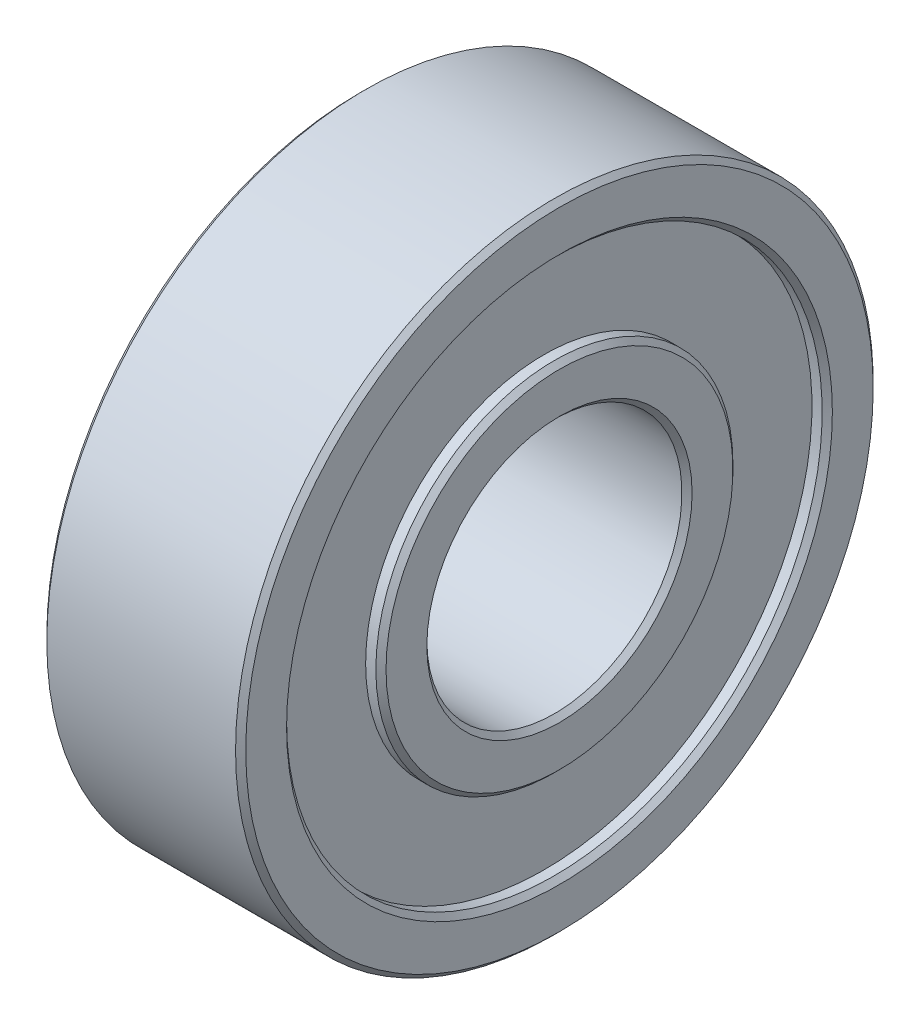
from build123d import *


with BuildPart() as part:
    # Sketch1 → Revolve1 (revolve)
    with BuildSketch(Plane(origin=(0, 0, 0), x_dir=(1, 0, 0), z_dir=(0, 1, 0)), mode=Mode.PRIVATE) as revolve1_sk:
        Polygon((0.127, 3.175), (4.826, 3.175), (4.953, 3.302), (4.953, 4.318), (4.826, 4.445), (4.572, 4.445), (4.572, 6.6675), (4.826, 6.6675), (4.953, 6.7945), (4.953, 7.8105), (4.826, 7.9375), (0.127, 7.9375), (0, 7.8105), (0, 6.7945), (0.127, 6.6675), (0.381, 6.6675), (0.381, 4.445), (0.127, 4.445), (0, 4.318), (0, 3.302), align=None)
    revolve(revolve1_sk.sketch.rotate(Axis((-29.078716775, 0, 0), (1, 0, 0)), 180), axis=Axis((-29.078716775, 0, 0), (1, 0, 0)))


solid = part.part
